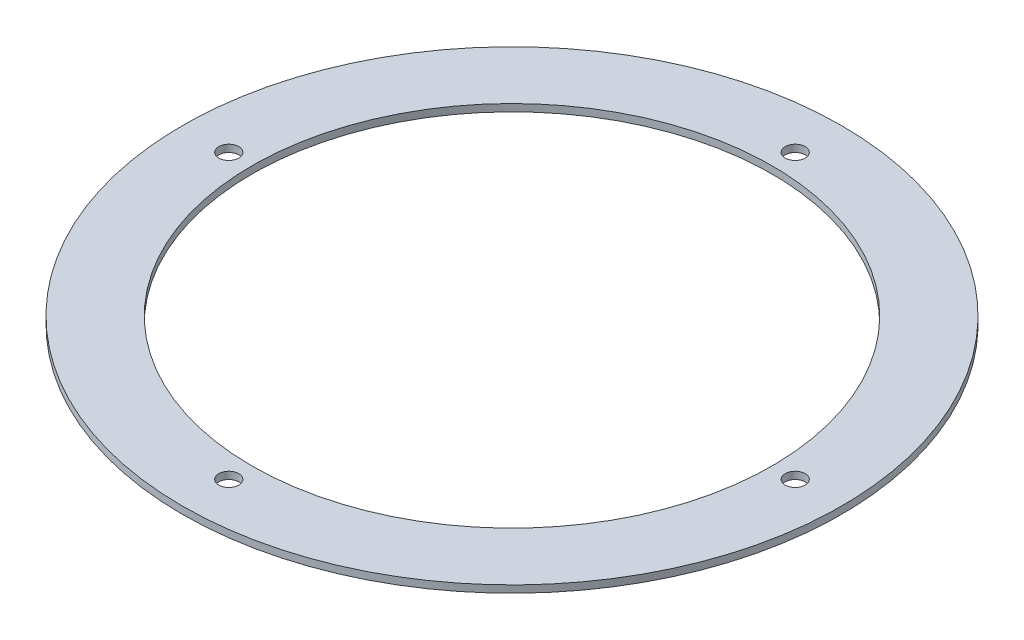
from build123d import *

# Parameters (mm, degrees)
SKETCH1_R                    = 81.28
SKETCH1_R_2                  = 64.135
BOSS_EXTRUDE1_DEPTH          = 1.778
F_10_0_1935_DIAMETER_HOLE1_D = 4.9149


with BuildPart() as part:
    # Sketch1 → Boss-Extrude1 (new body)
    with BuildSketch(Plane(origin=(0, 0, 0), x_dir=(1, 0, 0), z_dir=(0, 1, 0))):
        with Locations(Location((0, 0, 0), (0, 0, 270))):
            Circle(SKETCH1_R)
        with Locations(Location((0, 0, 0), (0, 0, 270))):
            Circle(SKETCH1_R_2, mode=Mode.SUBTRACT)
    extrude(amount=BOSS_EXTRUDE1_DEPTH)

    # 10 _0.1935_ Diameter Hole1 (through all)
    with Locations(Plane(origin=(0, 1.778, 0), x_dir=(1, 0, 0), z_dir=(0, 1, 0))):
        with Locations((-69.85, 0), (0, -69.85), (69.85, 0), (0, 69.85)):
            Hole(F_10_0_1935_DIAMETER_HOLE1_D / 2)


solid = part.part
